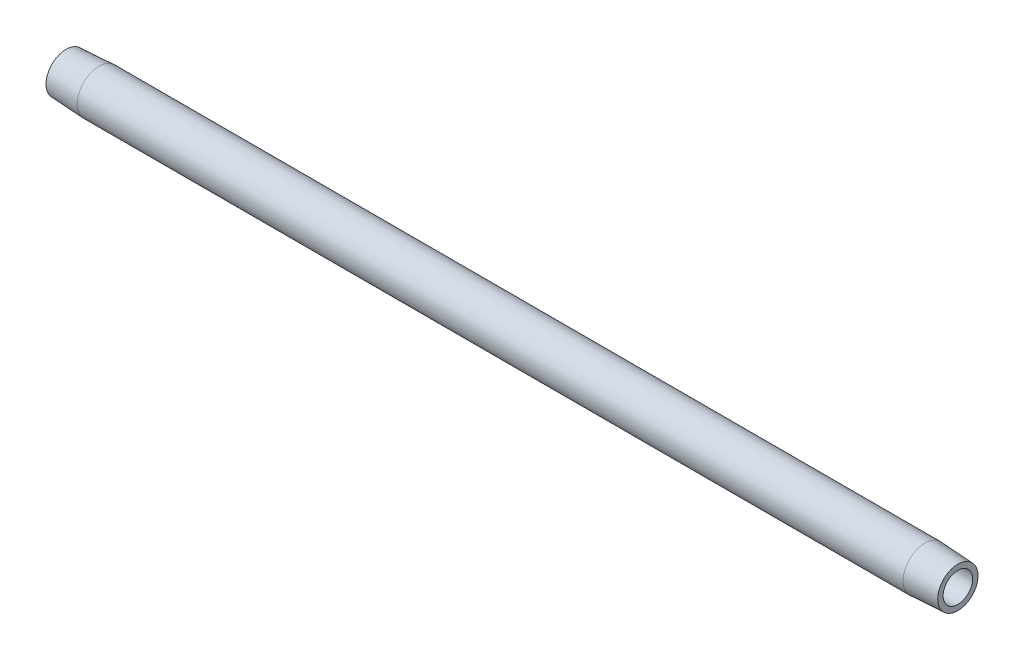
from build123d import *


with BuildPart() as part:
    # Sketch1 → Revolve1 (revolve)
    with BuildSketch(Plane(origin=(0, 0, 0), x_dir=(1, 0, 0), z_dir=(0, 1, 0)), mode=Mode.PRIVATE) as revolve1_sk:
        Polygon((279.4, 4.622776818), (0, 4.622776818), (0, 6.317526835), (10.3124, 6.857976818), (269.0876, 6.857976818), (279.4, 6.317526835), align=None)
    revolve(revolve1_sk.sketch.rotate(Axis((-6.375994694, 0, 0), (1, 0, 0)), 180), axis=Axis((-6.375994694, 0, 0), (1, 0, 0)))


solid = part.part
